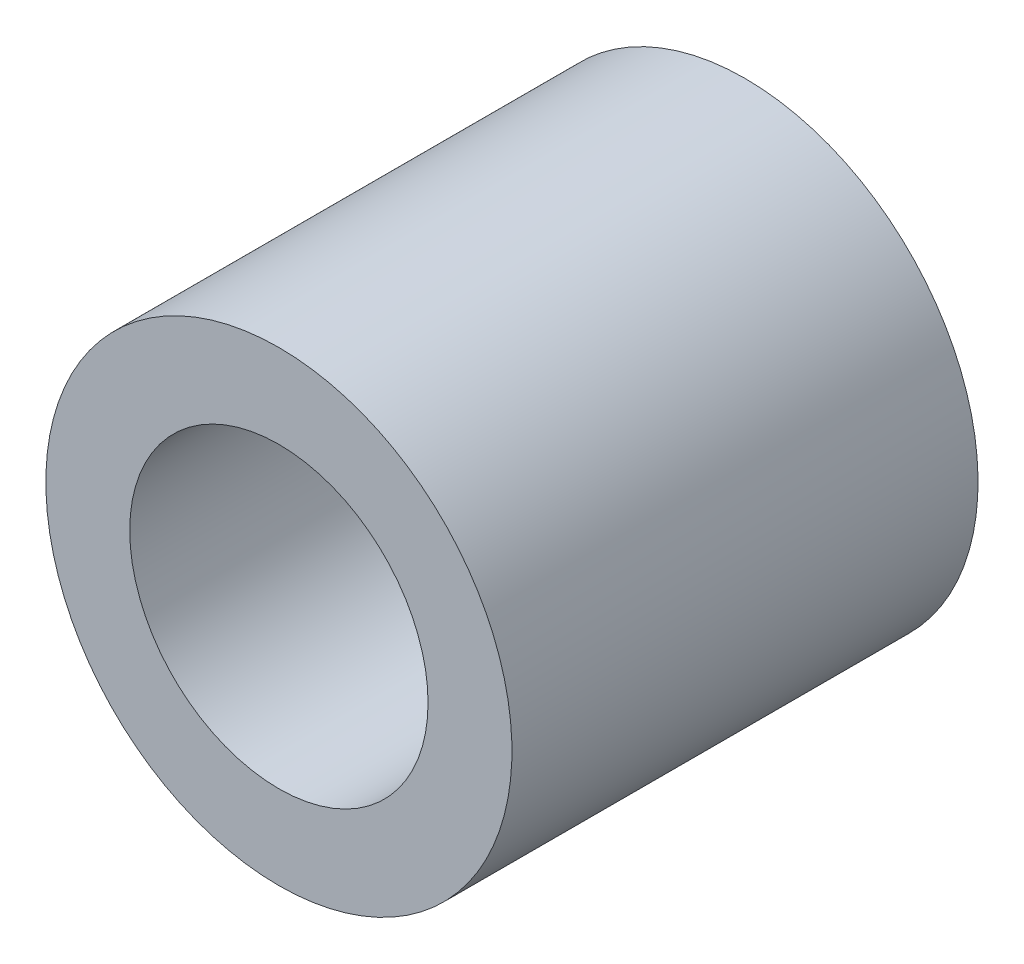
ISO-10303-21;
HEADER;
FILE_DESCRIPTION(('STEP AP214'),'2;1');
FILE_NAME('part.step','',(''),(''),'','','');
FILE_SCHEMA(('AUTOMOTIVE_DESIGN { 1 0 10303 214 1 1 1 1 }'));
ENDSEC;
DATA;
#1=APPLICATION_CONTEXT('core data for automotive mechanical design processes');
#2=APPLICATION_PROTOCOL_DEFINITION('international standard','automotive_design',2000,#1);
#3=PRODUCT_CONTEXT('',#1,'mechanical');
#4=PRODUCT('Part','Part','',(#3));
#5=PRODUCT_RELATED_PRODUCT_CATEGORY('part','',(#4));
#6=PRODUCT_DEFINITION_FORMATION('','',#4);
#7=PRODUCT_DEFINITION_CONTEXT('part definition',#1,'design');
#8=PRODUCT_DEFINITION('design','',#6,#7);
#9=PRODUCT_DEFINITION_SHAPE('','',#8);
#10=(LENGTH_UNIT() NAMED_UNIT(*) SI_UNIT(.MILLI.,.METRE.));
#11=(NAMED_UNIT(*) PLANE_ANGLE_UNIT() SI_UNIT($,.RADIAN.));
#12=(NAMED_UNIT(*) SI_UNIT($,.STERADIAN.) SOLID_ANGLE_UNIT());
#13=UNCERTAINTY_MEASURE_WITH_UNIT(LENGTH_MEASURE(1.E-05),#10,'distance_accuracy_value','');
#14=(GEOMETRIC_REPRESENTATION_CONTEXT(3) GLOBAL_UNCERTAINTY_ASSIGNED_CONTEXT((#13)) GLOBAL_UNIT_ASSIGNED_CONTEXT((#10,
#11,#12)) REPRESENTATION_CONTEXT('',''));
#15=CARTESIAN_POINT('',(0.,0.,0.));
#16=DIRECTION('',(0.,0.,1.));
#17=DIRECTION('',(1.,0.,0.));
#18=AXIS2_PLACEMENT_3D('',#15,#16,#17);
#19=CARTESIAN_POINT('',(0.,0.,-20.));
#20=DIRECTION('',(0.,0.,-1.));
#21=DIRECTION('',(0.,1.,0.));
#22=AXIS2_PLACEMENT_3D('',#19,#20,#21);
#23=CYLINDRICAL_SURFACE('',#22,12.5);
#24=CARTESIAN_POINT('',(0.,0.,0.));
#25=DIRECTION('',(0.,0.,-1.));
#26=DIRECTION('',(0.,1.,0.));
#27=AXIS2_PLACEMENT_3D('',#24,#25,#26);
#28=CIRCLE('',#27,12.5);
#29=CARTESIAN_POINT('',(0.,12.5,0.));
#30=VERTEX_POINT('',#29);
#31=EDGE_CURVE('E8',#30,#30,#28,.T.);
#32=ORIENTED_EDGE('',*,*,#31,.F.);
#33=EDGE_LOOP('',(#32));
#34=FACE_BOUND('',#33,.T.);
#35=CARTESIAN_POINT('',(0.,0.,25.));
#36=DIRECTION('',(0.,0.,1.));
#37=DIRECTION('',(0.,-1.,0.));
#38=AXIS2_PLACEMENT_3D('',#35,#36,#37);
#39=CIRCLE('',#38,12.5);
#40=CARTESIAN_POINT('',(0.,-12.5,25.));
#41=VERTEX_POINT('',#40);
#42=EDGE_CURVE('E18',#41,#41,#39,.T.);
#43=ORIENTED_EDGE('',*,*,#42,.F.);
#44=EDGE_LOOP('',(#43));
#45=FACE_BOUND('',#44,.T.);
#46=ADVANCED_FACE('F12',(#34,#45),#23,.T.);
#47=CARTESIAN_POINT('',(12.5,0.,0.));
#48=DIRECTION('',(0.,0.,1.));
#49=DIRECTION('',(0.,-1.,0.));
#50=AXIS2_PLACEMENT_3D('',#47,#48,#49);
#51=PLANE('',#50);
#52=CARTESIAN_POINT('',(0.,0.,0.));
#53=DIRECTION('',(0.,0.,1.));
#54=DIRECTION('',(0.,-1.,0.));
#55=AXIS2_PLACEMENT_3D('',#52,#53,#54);
#56=CIRCLE('',#55,8.);
#57=CARTESIAN_POINT('',(0.,-8.,0.));
#58=VERTEX_POINT('',#57);
#59=EDGE_CURVE('E22',#58,#58,#56,.T.);
#60=ORIENTED_EDGE('',*,*,#59,.T.);
#61=EDGE_LOOP('',(#60));
#62=FACE_BOUND('',#61,.T.);
#63=ORIENTED_EDGE('',*,*,#31,.T.);
#64=EDGE_LOOP('',(#63));
#65=FACE_BOUND('',#64,.T.);
#66=ADVANCED_FACE('F36',(#62,#65),#51,.F.);
#67=CARTESIAN_POINT('',(0.,0.,25.));
#68=DIRECTION('',(0.,0.,1.));
#69=DIRECTION('',(0.,-1.,0.));
#70=AXIS2_PLACEMENT_3D('',#67,#68,#69);
#71=PLANE('',#70);
#72=CARTESIAN_POINT('',(0.,0.,25.));
#73=DIRECTION('',(0.,0.,1.));
#74=DIRECTION('',(0.,-1.,0.));
#75=AXIS2_PLACEMENT_3D('',#72,#73,#74);
#76=CIRCLE('',#75,8.);
#77=CARTESIAN_POINT('',(0.,-8.,25.));
#78=VERTEX_POINT('',#77);
#79=EDGE_CURVE('E26',#78,#78,#76,.T.);
#80=ORIENTED_EDGE('',*,*,#79,.F.);
#81=EDGE_LOOP('',(#80));
#82=FACE_BOUND('',#81,.T.);
#83=ORIENTED_EDGE('',*,*,#42,.T.);
#84=EDGE_LOOP('',(#83));
#85=FACE_BOUND('',#84,.T.);
#86=ADVANCED_FACE('F34',(#82,#85),#71,.T.);
#87=CARTESIAN_POINT('',(0.,0.,0.));
#88=DIRECTION('',(0.,0.,1.));
#89=DIRECTION('',(0.,-1.,0.));
#90=AXIS2_PLACEMENT_3D('',#87,#88,#89);
#91=CYLINDRICAL_SURFACE('',#90,8.);
#92=ORIENTED_EDGE('',*,*,#59,.F.);
#93=EDGE_LOOP('',(#92));
#94=FACE_BOUND('',#93,.T.);
#95=ORIENTED_EDGE('',*,*,#79,.T.);
#96=EDGE_LOOP('',(#95));
#97=FACE_BOUND('',#96,.T.);
#98=ADVANCED_FACE('F32',(#94,#97),#91,.F.);
#99=CLOSED_SHELL('',(#46,#66,#86,#98));
#100=MANIFOLD_SOLID_BREP('B1',#99);
#101=ADVANCED_BREP_SHAPE_REPRESENTATION('',(#18,#100),#14);
#102=SHAPE_DEFINITION_REPRESENTATION(#9,#101);
ENDSEC;
END-ISO-10303-21;
